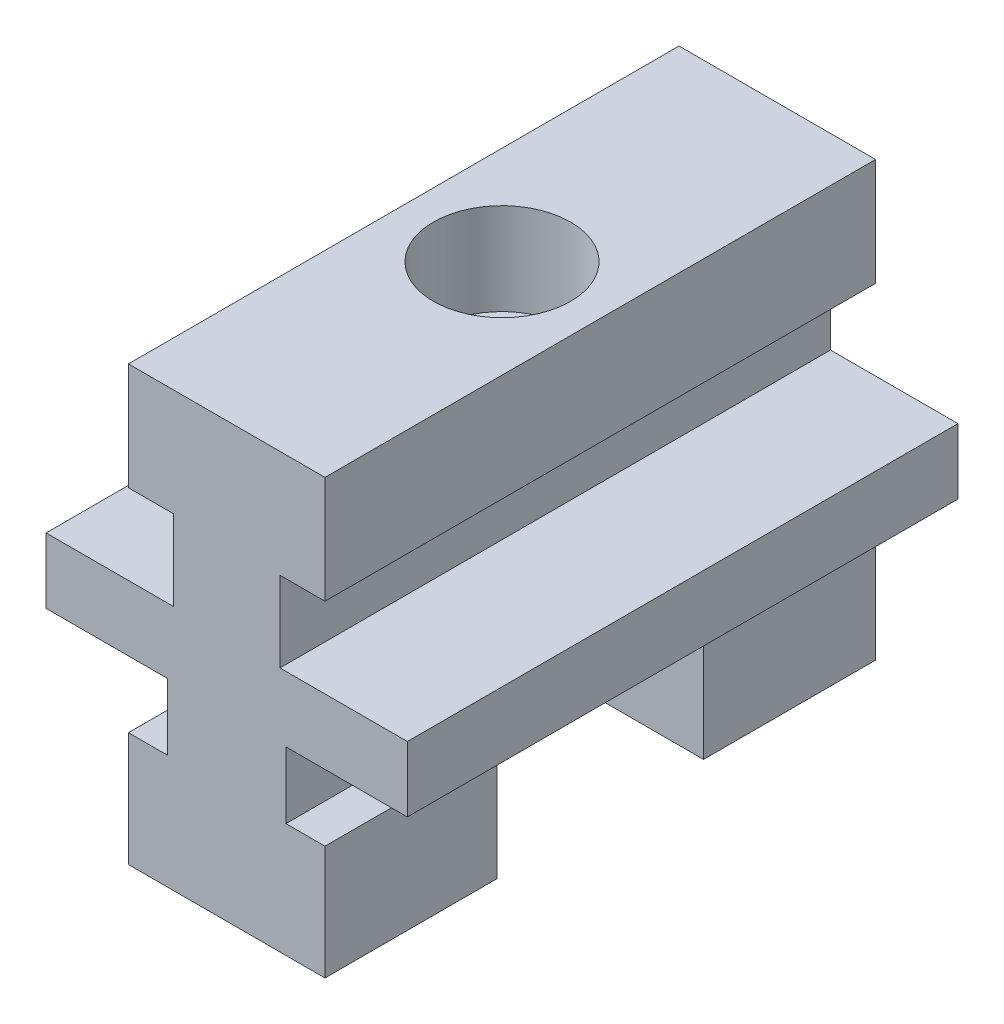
ISO-10303-21;
HEADER;
FILE_DESCRIPTION(('STEP AP214'),'2;1');
FILE_NAME('part.step','',(''),(''),'','','');
FILE_SCHEMA(('AUTOMOTIVE_DESIGN { 1 0 10303 214 1 1 1 1 }'));
ENDSEC;
DATA;
#1=APPLICATION_CONTEXT('core data for automotive mechanical design processes');
#2=APPLICATION_PROTOCOL_DEFINITION('international standard','automotive_design',2000,#1);
#3=PRODUCT_CONTEXT('',#1,'mechanical');
#4=PRODUCT('Part','Part','',(#3));
#5=PRODUCT_RELATED_PRODUCT_CATEGORY('part','',(#4));
#6=PRODUCT_DEFINITION_FORMATION('','',#4);
#7=PRODUCT_DEFINITION_CONTEXT('part definition',#1,'design');
#8=PRODUCT_DEFINITION('design','',#6,#7);
#9=PRODUCT_DEFINITION_SHAPE('','',#8);
#10=(LENGTH_UNIT() NAMED_UNIT(*) SI_UNIT(.MILLI.,.METRE.));
#11=(NAMED_UNIT(*) PLANE_ANGLE_UNIT() SI_UNIT($,.RADIAN.));
#12=(NAMED_UNIT(*) SI_UNIT($,.STERADIAN.) SOLID_ANGLE_UNIT());
#13=UNCERTAINTY_MEASURE_WITH_UNIT(LENGTH_MEASURE(1.E-05),#10,'distance_accuracy_value','');
#14=(GEOMETRIC_REPRESENTATION_CONTEXT(3) GLOBAL_UNCERTAINTY_ASSIGNED_CONTEXT((#13)) GLOBAL_UNIT_ASSIGNED_CONTEXT((#10,
#11,#12)) REPRESENTATION_CONTEXT('',''));
#15=CARTESIAN_POINT('',(0.,0.,0.));
#16=DIRECTION('',(0.,0.,1.));
#17=DIRECTION('',(1.,0.,0.));
#18=AXIS2_PLACEMENT_3D('',#15,#16,#17);
#19=CARTESIAN_POINT('',(6.79999999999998,-3.10199999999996,7.14375));
#20=DIRECTION('',(0.,0.,1.));
#21=DIRECTION('',(1.,0.,0.));
#22=AXIS2_PLACEMENT_3D('',#19,#20,#21);
#23=PLANE('',#22);
#24=DIRECTION('',(1.,0.,0.));
#25=VECTOR('',#24,1.);
#26=CARTESIAN_POINT('',(6.79999999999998,-3.10199999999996,7.14375));
#27=LINE('',#26,#25);
#28=CARTESIAN_POINT('',(-4.10000000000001,-3.10199999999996,7.14375));
#29=VERTEX_POINT('',#28);
#30=CARTESIAN_POINT('',(4.10000000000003,-3.10199999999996,7.14375));
#31=VERTEX_POINT('',#30);
#32=EDGE_CURVE('E239',#29,#31,#27,.T.);
#33=ORIENTED_EDGE('',*,*,#32,.T.);
#34=DIRECTION('',(0.,1.,0.));
#35=VECTOR('',#34,1.);
#36=CARTESIAN_POINT('',(4.10000000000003,-3.10199999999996,7.14375));
#37=LINE('',#36,#35);
#38=CARTESIAN_POINT('',(4.10000000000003,-4.59999999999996,7.14375));
#39=VERTEX_POINT('',#38);
#40=EDGE_CURVE('E245',#39,#31,#37,.T.);
#41=ORIENTED_EDGE('',*,*,#40,.F.);
#42=DIRECTION('',(1.,0.,0.));
#43=VECTOR('',#42,1.);
#44=CARTESIAN_POINT('',(4.10000000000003,-4.59999999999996,7.14375));
#45=LINE('',#44,#43);
#46=CARTESIAN_POINT('',(6.79999999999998,-4.59999999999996,7.14375));
#47=VERTEX_POINT('',#46);
#48=EDGE_CURVE('E349',#47,#39,#45,.F.);
#49=ORIENTED_EDGE('',*,*,#48,.F.);
#50=DIRECTION('',(0.,1.,0.));
#51=VECTOR('',#50,1.);
#52=CARTESIAN_POINT('',(6.79999999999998,-4.59999999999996,7.14375));
#53=LINE('',#52,#51);
#54=CARTESIAN_POINT('',(6.79999999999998,-12.5,7.14375));
#55=VERTEX_POINT('',#54);
#56=EDGE_CURVE('E355',#55,#47,#53,.T.);
#57=ORIENTED_EDGE('',*,*,#56,.F.);
#58=DIRECTION('',(1.,0.,0.));
#59=VECTOR('',#58,1.);
#60=CARTESIAN_POINT('',(6.79999999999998,-12.5,7.14375));
#61=LINE('',#60,#59);
#62=CARTESIAN_POINT('',(-6.80000000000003,-12.5,7.14375));
#63=VERTEX_POINT('',#62);
#64=EDGE_CURVE('E209',#63,#55,#61,.T.);
#65=ORIENTED_EDGE('',*,*,#64,.F.);
#66=DIRECTION('',(0.,1.,0.));
#67=VECTOR('',#66,1.);
#68=CARTESIAN_POINT('',(-6.80000000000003,-12.5,7.14375));
#69=LINE('',#68,#67);
#70=CARTESIAN_POINT('',(-6.80000000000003,-4.59999999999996,7.14375));
#71=VERTEX_POINT('',#70);
#72=EDGE_CURVE('E212',#71,#63,#69,.F.);
#73=ORIENTED_EDGE('',*,*,#72,.F.);
#74=DIRECTION('',(1.,0.,0.));
#75=VECTOR('',#74,1.);
#76=CARTESIAN_POINT('',(-6.80000000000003,-4.59999999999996,7.14375));
#77=LINE('',#76,#75);
#78=CARTESIAN_POINT('',(-4.10000000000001,-4.59999999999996,7.14375));
#79=VERTEX_POINT('',#78);
#80=EDGE_CURVE('E215',#79,#71,#77,.F.);
#81=ORIENTED_EDGE('',*,*,#80,.F.);
#82=DIRECTION('',(0.,1.,0.));
#83=VECTOR('',#82,1.);
#84=CARTESIAN_POINT('',(-4.10000000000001,-3.10199999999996,7.14375));
#85=LINE('',#84,#83);
#86=EDGE_CURVE('E243',#29,#79,#85,.F.);
#87=ORIENTED_EDGE('',*,*,#86,.F.);
#88=EDGE_LOOP('',(#33,#41,#49,#57,#65,#73,#81,#87));
#89=FACE_BOUND('',#88,.T.);
#90=ADVANCED_FACE('F15',(#89),#23,.F.);
#91=CARTESIAN_POINT('',(6.79999999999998,-12.5,-7.14375));
#92=DIRECTION('',(0.,0.,-1.));
#93=DIRECTION('',(-1.,0.,0.));
#94=AXIS2_PLACEMENT_3D('',#91,#92,#93);
#95=PLANE('',#94);
#96=DIRECTION('',(1.,0.,0.));
#97=VECTOR('',#96,1.);
#98=CARTESIAN_POINT('',(-6.80000000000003,-4.59999999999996,-7.14375));
#99=LINE('',#98,#97);
#100=CARTESIAN_POINT('',(-6.80000000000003,-4.59999999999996,-7.14375));
#101=VERTEX_POINT('',#100);
#102=CARTESIAN_POINT('',(-4.10000000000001,-4.59999999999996,-7.14375));
#103=VERTEX_POINT('',#102);
#104=EDGE_CURVE('E324',#101,#103,#99,.T.);
#105=ORIENTED_EDGE('',*,*,#104,.F.);
#106=DIRECTION('',(0.,1.,0.));
#107=VECTOR('',#106,1.);
#108=CARTESIAN_POINT('',(-6.80000000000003,-12.5,-7.14375));
#109=LINE('',#108,#107);
#110=CARTESIAN_POINT('',(-6.80000000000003,-12.5,-7.14375));
#111=VERTEX_POINT('',#110);
#112=EDGE_CURVE('E317',#111,#101,#109,.T.);
#113=ORIENTED_EDGE('',*,*,#112,.F.);
#114=DIRECTION('',(1.,0.,0.));
#115=VECTOR('',#114,1.);
#116=CARTESIAN_POINT('',(6.79999999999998,-12.5,-7.14375));
#117=LINE('',#116,#115);
#118=CARTESIAN_POINT('',(6.79999999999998,-12.5,-7.14375));
#119=VERTEX_POINT('',#118);
#120=EDGE_CURVE('E311',#119,#111,#117,.F.);
#121=ORIENTED_EDGE('',*,*,#120,.F.);
#122=DIRECTION('',(0.,1.,0.));
#123=VECTOR('',#122,1.);
#124=CARTESIAN_POINT('',(6.79999999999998,-4.59999999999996,-7.14375));
#125=LINE('',#124,#123);
#126=CARTESIAN_POINT('',(6.79999999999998,-4.59999999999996,-7.14375));
#127=VERTEX_POINT('',#126);
#128=EDGE_CURVE('E305',#127,#119,#125,.F.);
#129=ORIENTED_EDGE('',*,*,#128,.F.);
#130=DIRECTION('',(1.,0.,0.));
#131=VECTOR('',#130,1.);
#132=CARTESIAN_POINT('',(4.10000000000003,-4.59999999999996,-7.14375));
#133=LINE('',#132,#131);
#134=CARTESIAN_POINT('',(4.10000000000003,-4.59999999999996,-7.14375));
#135=VERTEX_POINT('',#134);
#136=EDGE_CURVE('E299',#135,#127,#133,.T.);
#137=ORIENTED_EDGE('',*,*,#136,.F.);
#138=DIRECTION('',(0.,1.,0.));
#139=VECTOR('',#138,1.);
#140=CARTESIAN_POINT('',(4.10000000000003,-12.5,-7.14375));
#141=LINE('',#140,#139);
#142=CARTESIAN_POINT('',(4.10000000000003,-3.10199999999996,-7.14375));
#143=VERTEX_POINT('',#142);
#144=EDGE_CURVE('E241',#143,#135,#141,.F.);
#145=ORIENTED_EDGE('',*,*,#144,.F.);
#146=DIRECTION('',(1.,0.,0.));
#147=VECTOR('',#146,1.);
#148=CARTESIAN_POINT('',(6.79999999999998,-3.10199999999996,-7.14375));
#149=LINE('',#148,#147);
#150=CARTESIAN_POINT('',(-4.10000000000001,-3.10199999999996,-7.14375));
#151=VERTEX_POINT('',#150);
#152=EDGE_CURVE('E237',#143,#151,#149,.F.);
#153=ORIENTED_EDGE('',*,*,#152,.T.);
#154=DIRECTION('',(0.,1.,0.));
#155=VECTOR('',#154,1.);
#156=CARTESIAN_POINT('',(-4.10000000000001,-4.59999999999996,-7.14375));
#157=LINE('',#156,#155);
#158=EDGE_CURVE('E330',#103,#151,#157,.T.);
#159=ORIENTED_EDGE('',*,*,#158,.F.);
#160=EDGE_LOOP('',(#105,#113,#121,#129,#137,#145,#153,#159));
#161=FACE_BOUND('',#160,.T.);
#162=ADVANCED_FACE('F567',(#161),#95,.F.);
#163=CARTESIAN_POINT('',(6.79999999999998,-3.10199999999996,-7.14375));
#164=DIRECTION('',(0.,1.,0.));
#165=DIRECTION('',(0.,0.,1.));
#166=AXIS2_PLACEMENT_3D('',#163,#164,#165);
#167=PLANE('',#166);
#168=CARTESIAN_POINT('',(0.,-3.10199999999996,0.));
#169=DIRECTION('',(0.,-1.,0.));
#170=DIRECTION('',(0.,0.,-1.));
#171=AXIS2_PLACEMENT_3D('',#168,#169,#170);
#172=CIRCLE('',#171,2.99999999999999);
#173=CARTESIAN_POINT('',(0.,-3.10199999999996,-3.));
#174=VERTEX_POINT('',#173);
#175=EDGE_CURVE('E19',#174,#174,#172,.F.);
#176=ORIENTED_EDGE('',*,*,#175,.T.);
#177=EDGE_LOOP('',(#176));
#178=FACE_BOUND('',#177,.T.);
#179=ORIENTED_EDGE('',*,*,#152,.F.);
#180=DIRECTION('',(0.,0.,-1.));
#181=VECTOR('',#180,1.);
#182=CARTESIAN_POINT('',(4.10000000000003,-3.10199999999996,0.));
#183=LINE('',#182,#181);
#184=EDGE_CURVE('E293',#31,#143,#183,.T.);
#185=ORIENTED_EDGE('',*,*,#184,.F.);
#186=ORIENTED_EDGE('',*,*,#32,.F.);
#187=DIRECTION('',(0.,0.,1.));
#188=VECTOR('',#187,1.);
#189=CARTESIAN_POINT('',(-4.10000000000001,-3.10199999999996,0.));
#190=LINE('',#189,#188);
#191=EDGE_CURVE('E327',#151,#29,#190,.T.);
#192=ORIENTED_EDGE('',*,*,#191,.F.);
#193=EDGE_LOOP('',(#179,#185,#186,#192));
#194=FACE_BOUND('',#193,.T.);
#195=ADVANCED_FACE('F413',(#178,#194),#167,.F.);
#196=CARTESIAN_POINT('',(0.,11.15,0.));
#197=DIRECTION('',(0.,-1.,0.));
#198=DIRECTION('',(0.,0.,-1.));
#199=AXIS2_PLACEMENT_3D('',#196,#197,#198);
#200=CYLINDRICAL_SURFACE('',#199,2.99999999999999);
#201=CARTESIAN_POINT('',(0.,11.15,0.));
#202=DIRECTION('',(0.,-1.,0.));
#203=DIRECTION('',(0.,0.,-1.));
#204=AXIS2_PLACEMENT_3D('',#201,#202,#203);
#205=CIRCLE('',#204,2.99999999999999);
#206=CARTESIAN_POINT('',(0.,11.15,-2.99999999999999));
#207=VERTEX_POINT('',#206);
#208=EDGE_CURVE('E251',#207,#207,#205,.F.);
#209=ORIENTED_EDGE('',*,*,#208,.T.);
#210=EDGE_LOOP('',(#209));
#211=FACE_BOUND('',#210,.T.);
#212=ORIENTED_EDGE('',*,*,#175,.F.);
#213=EDGE_LOOP('',(#212));
#214=FACE_BOUND('',#213,.T.);
#215=ADVANCED_FACE('F563',(#211,#214),#200,.F.);
#216=CARTESIAN_POINT('',(-6.80000000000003,-4.59999999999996,0.));
#217=DIRECTION('',(0.,1.,0.));
#218=DIRECTION('',(0.,0.,1.));
#219=AXIS2_PLACEMENT_3D('',#216,#217,#218);
#220=PLANE('',#219);
#221=DIRECTION('',(1.,0.,0.));
#222=VECTOR('',#221,1.);
#223=CARTESIAN_POINT('',(0.,-4.59999999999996,19.05));
#224=LINE('',#223,#222);
#225=CARTESIAN_POINT('',(-4.1,-4.59999999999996,19.05));
#226=VERTEX_POINT('',#225);
#227=CARTESIAN_POINT('',(-6.80000000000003,-4.59999999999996,19.05));
#228=VERTEX_POINT('',#227);
#229=EDGE_CURVE('E369',#226,#228,#224,.F.);
#230=ORIENTED_EDGE('',*,*,#229,.F.);
#231=DIRECTION('',(0.,0.,1.));
#232=VECTOR('',#231,1.);
#233=CARTESIAN_POINT('',(-4.10000000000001,-4.59999999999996,0.));
#234=LINE('',#233,#232);
#235=EDGE_CURVE('E226',#79,#226,#234,.T.);
#236=ORIENTED_EDGE('',*,*,#235,.F.);
#237=ORIENTED_EDGE('',*,*,#80,.T.);
#238=DIRECTION('',(0.,0.,1.));
#239=VECTOR('',#238,1.);
#240=CARTESIAN_POINT('',(-6.80000000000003,-4.59999999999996,0.));
#241=LINE('',#240,#239);
#242=EDGE_CURVE('E220',#228,#71,#241,.F.);
#243=ORIENTED_EDGE('',*,*,#242,.F.);
#244=EDGE_LOOP('',(#230,#236,#237,#243));
#245=FACE_BOUND('',#244,.T.);
#246=ADVANCED_FACE('F224',(#245),#220,.T.);
#247=CARTESIAN_POINT('',(-6.80000000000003,-12.5,0.));
#248=DIRECTION('',(-1.,0.,0.));
#249=DIRECTION('',(0.,0.,1.));
#250=AXIS2_PLACEMENT_3D('',#247,#248,#249);
#251=PLANE('',#250);
#252=DIRECTION('',(0.,1.,0.));
#253=VECTOR('',#252,1.);
#254=CARTESIAN_POINT('',(-6.80000000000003,2.50000000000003,19.05));
#255=LINE('',#254,#253);
#256=CARTESIAN_POINT('',(-6.80000000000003,-12.5,19.05));
#257=VERTEX_POINT('',#256);
#258=EDGE_CURVE('E230',#228,#257,#255,.F.);
#259=ORIENTED_EDGE('',*,*,#258,.F.);
#260=ORIENTED_EDGE('',*,*,#242,.T.);
#261=ORIENTED_EDGE('',*,*,#72,.T.);
#262=DIRECTION('',(0.,0.,-1.));
#263=VECTOR('',#262,1.);
#264=CARTESIAN_POINT('',(-6.80000000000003,-12.5,0.));
#265=LINE('',#264,#263);
#266=EDGE_CURVE('E233',#257,#63,#265,.T.);
#267=ORIENTED_EDGE('',*,*,#266,.F.);
#268=EDGE_LOOP('',(#259,#260,#261,#267));
#269=FACE_BOUND('',#268,.T.);
#270=ADVANCED_FACE('F228',(#269),#251,.T.);
#271=CARTESIAN_POINT('',(6.79999999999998,-12.5,0.));
#272=DIRECTION('',(0.,-1.,0.));
#273=DIRECTION('',(0.,0.,-1.));
#274=AXIS2_PLACEMENT_3D('',#271,#272,#273);
#275=PLANE('',#274);
#276=DIRECTION('',(1.,0.,0.));
#277=VECTOR('',#276,1.);
#278=CARTESIAN_POINT('',(0.,-12.5,19.05));
#279=LINE('',#278,#277);
#280=CARTESIAN_POINT('',(6.79999999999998,-12.5,19.05));
#281=VERTEX_POINT('',#280);
#282=EDGE_CURVE('E361',#257,#281,#279,.T.);
#283=ORIENTED_EDGE('',*,*,#282,.F.);
#284=ORIENTED_EDGE('',*,*,#266,.T.);
#285=ORIENTED_EDGE('',*,*,#64,.T.);
#286=DIRECTION('',(0.,0.,-1.));
#287=VECTOR('',#286,1.);
#288=CARTESIAN_POINT('',(6.79999999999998,-12.5,0.));
#289=LINE('',#288,#287);
#290=EDGE_CURVE('E352',#281,#55,#289,.T.);
#291=ORIENTED_EDGE('',*,*,#290,.F.);
#292=EDGE_LOOP('',(#283,#284,#285,#291));
#293=FACE_BOUND('',#292,.T.);
#294=ADVANCED_FACE('F359',(#293),#275,.T.);
#295=CARTESIAN_POINT('',(6.79999999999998,-4.59999999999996,0.));
#296=DIRECTION('',(1.,0.,0.));
#297=DIRECTION('',(0.,0.,-1.));
#298=AXIS2_PLACEMENT_3D('',#295,#296,#297);
#299=PLANE('',#298);
#300=DIRECTION('',(0.,1.,0.));
#301=VECTOR('',#300,1.);
#302=CARTESIAN_POINT('',(6.79999999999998,2.50000000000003,19.05));
#303=LINE('',#302,#301);
#304=CARTESIAN_POINT('',(6.79999999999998,-4.59999999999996,19.05));
#305=VERTEX_POINT('',#304);
#306=EDGE_CURVE('E365',#281,#305,#303,.T.);
#307=ORIENTED_EDGE('',*,*,#306,.F.);
#308=ORIENTED_EDGE('',*,*,#290,.T.);
#309=ORIENTED_EDGE('',*,*,#56,.T.);
#310=DIRECTION('',(0.,0.,1.));
#311=VECTOR('',#310,1.);
#312=CARTESIAN_POINT('',(6.79999999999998,-4.59999999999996,0.));
#313=LINE('',#312,#311);
#314=EDGE_CURVE('E346',#305,#47,#313,.F.);
#315=ORIENTED_EDGE('',*,*,#314,.F.);
#316=EDGE_LOOP('',(#307,#308,#309,#315));
#317=FACE_BOUND('',#316,.T.);
#318=ADVANCED_FACE('F424',(#317),#299,.T.);
#319=CARTESIAN_POINT('',(4.10000000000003,-4.59999999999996,0.));
#320=DIRECTION('',(0.,1.,0.));
#321=DIRECTION('',(0.,0.,1.));
#322=AXIS2_PLACEMENT_3D('',#319,#320,#321);
#323=PLANE('',#322);
#324=DIRECTION('',(1.,0.,0.));
#325=VECTOR('',#324,1.);
#326=CARTESIAN_POINT('',(0.,-4.59999999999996,19.05));
#327=LINE('',#326,#325);
#328=CARTESIAN_POINT('',(4.10000000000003,-4.59999999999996,19.05));
#329=VERTEX_POINT('',#328);
#330=EDGE_CURVE('E422',#305,#329,#327,.F.);
#331=ORIENTED_EDGE('',*,*,#330,.F.);
#332=ORIENTED_EDGE('',*,*,#314,.T.);
#333=ORIENTED_EDGE('',*,*,#48,.T.);
#334=DIRECTION('',(0.,0.,-1.));
#335=VECTOR('',#334,1.);
#336=CARTESIAN_POINT('',(4.10000000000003,-4.59999999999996,0.));
#337=LINE('',#336,#335);
#338=EDGE_CURVE('E287',#329,#39,#337,.T.);
#339=ORIENTED_EDGE('',*,*,#338,.F.);
#340=EDGE_LOOP('',(#331,#332,#333,#339));
#341=FACE_BOUND('',#340,.T.);
#342=ADVANCED_FACE('F420',(#341),#323,.T.);
#343=CARTESIAN_POINT('',(-3.68299999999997,4.52187500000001,19.05));
#344=DIRECTION('',(1.,0.,0.));
#345=DIRECTION('',(0.,0.,-1.));
#346=AXIS2_PLACEMENT_3D('',#343,#344,#345);
#347=PLANE('',#346);
#348=DIRECTION('',(0.,0.,-1.));
#349=VECTOR('',#348,1.);
#350=CARTESIAN_POINT('',(-3.68299999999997,4.52187500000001,19.05));
#351=LINE('',#350,#349);
#352=CARTESIAN_POINT('',(-3.68299999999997,4.52187500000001,-19.05));
#353=VERTEX_POINT('',#352);
#354=CARTESIAN_POINT('',(-3.68299999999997,4.52187500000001,19.05));
#355=VERTEX_POINT('',#354);
#356=EDGE_CURVE('E343',#353,#355,#351,.F.);
#357=ORIENTED_EDGE('',*,*,#356,.T.);
#358=DIRECTION('',(0.,1.,0.));
#359=VECTOR('',#358,1.);
#360=CARTESIAN_POINT('',(-3.68299999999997,2.50000000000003,19.05));
#361=LINE('',#360,#359);
#362=CARTESIAN_POINT('',(-3.68299999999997,10.078125,19.05));
#363=VERTEX_POINT('',#362);
#364=EDGE_CURVE('E261',#363,#355,#361,.F.);
#365=ORIENTED_EDGE('',*,*,#364,.F.);
#366=DIRECTION('',(0.,0.,1.));
#367=VECTOR('',#366,1.);
#368=CARTESIAN_POINT('',(-3.68299999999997,10.078125,19.05));
#369=LINE('',#368,#367);
#370=CARTESIAN_POINT('',(-3.68299999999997,10.078125,-19.05));
#371=VERTEX_POINT('',#370);
#372=EDGE_CURVE('E255',#363,#371,#369,.F.);
#373=ORIENTED_EDGE('',*,*,#372,.T.);
#374=DIRECTION('',(0.,1.,0.));
#375=VECTOR('',#374,1.);
#376=CARTESIAN_POINT('',(-3.68299999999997,2.50000000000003,-19.05));
#377=LINE('',#376,#375);
#378=EDGE_CURVE('E390',#371,#353,#377,.F.);
#379=ORIENTED_EDGE('',*,*,#378,.T.);
#380=EDGE_LOOP('',(#357,#365,#373,#379));
#381=FACE_BOUND('',#380,.T.);
#382=ADVANCED_FACE('F387',(#381),#347,.F.);
#383=CARTESIAN_POINT('',(-12.5,4.52187500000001,19.05));
#384=DIRECTION('',(0.,-1.,0.));
#385=DIRECTION('',(0.,0.,-1.));
#386=AXIS2_PLACEMENT_3D('',#383,#384,#385);
#387=PLANE('',#386);
#388=DIRECTION('',(0.,0.,1.));
#389=VECTOR('',#388,1.);
#390=CARTESIAN_POINT('',(-12.5,4.52187500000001,0.));
#391=LINE('',#390,#389);
#392=CARTESIAN_POINT('',(-12.5,4.52187500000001,19.05));
#393=VERTEX_POINT('',#392);
#394=CARTESIAN_POINT('',(-12.5,4.52187500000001,-19.05));
#395=VERTEX_POINT('',#394);
#396=EDGE_CURVE('E340',#393,#395,#391,.F.);
#397=ORIENTED_EDGE('',*,*,#396,.F.);
#398=DIRECTION('',(1.,0.,0.));
#399=VECTOR('',#398,1.);
#400=CARTESIAN_POINT('',(0.,4.52187500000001,19.05));
#401=LINE('',#400,#399);
#402=EDGE_CURVE('E382',#355,#393,#401,.F.);
#403=ORIENTED_EDGE('',*,*,#402,.F.);
#404=ORIENTED_EDGE('',*,*,#356,.F.);
#405=DIRECTION('',(1.,0.,0.));
#406=VECTOR('',#405,1.);
#407=CARTESIAN_POINT('',(0.,4.52187500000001,-19.05));
#408=LINE('',#407,#406);
#409=EDGE_CURVE('E395',#353,#395,#408,.F.);
#410=ORIENTED_EDGE('',*,*,#409,.T.);
#411=EDGE_LOOP('',(#397,#403,#404,#410));
#412=FACE_BOUND('',#411,.T.);
#413=ADVANCED_FACE('F393',(#412),#387,.F.);
#414=CARTESIAN_POINT('',(-12.5,0.,0.));
#415=DIRECTION('',(-1.,0.,0.));
#416=DIRECTION('',(0.,0.,1.));
#417=AXIS2_PLACEMENT_3D('',#414,#415,#416);
#418=PLANE('',#417);
#419=DIRECTION('',(0.,0.,-1.));
#420=VECTOR('',#419,1.);
#421=CARTESIAN_POINT('',(-12.5,0.,0.));
#422=LINE('',#421,#420);
#423=CARTESIAN_POINT('',(-12.5,0.,19.05));
#424=VERTEX_POINT('',#423);
#425=CARTESIAN_POINT('',(-12.5,0.,-19.05));
#426=VERTEX_POINT('',#425);
#427=EDGE_CURVE('E337',#424,#426,#422,.T.);
#428=ORIENTED_EDGE('',*,*,#427,.F.);
#429=DIRECTION('',(0.,1.,0.));
#430=VECTOR('',#429,1.);
#431=CARTESIAN_POINT('',(-12.5,2.50000000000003,19.05));
#432=LINE('',#431,#430);
#433=EDGE_CURVE('E379',#393,#424,#432,.F.);
#434=ORIENTED_EDGE('',*,*,#433,.F.);
#435=ORIENTED_EDGE('',*,*,#396,.T.);
#436=DIRECTION('',(0.,1.,0.));
#437=VECTOR('',#436,1.);
#438=CARTESIAN_POINT('',(-12.5,2.50000000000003,-19.05));
#439=LINE('',#438,#437);
#440=EDGE_CURVE('E456',#395,#426,#439,.F.);
#441=ORIENTED_EDGE('',*,*,#440,.T.);
#442=EDGE_LOOP('',(#428,#434,#435,#441));
#443=FACE_BOUND('',#442,.T.);
#444=ADVANCED_FACE('F398',(#443),#418,.T.);
#445=CARTESIAN_POINT('',(-4.09999999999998,0.,0.));
#446=DIRECTION('',(0.,-1.,0.));
#447=DIRECTION('',(0.,0.,-1.));
#448=AXIS2_PLACEMENT_3D('',#445,#446,#447);
#449=PLANE('',#448);
#450=DIRECTION('',(1.,0.,0.));
#451=VECTOR('',#450,1.);
#452=CARTESIAN_POINT('',(0.,0.,-19.05));
#453=LINE('',#452,#451);
#454=CARTESIAN_POINT('',(-4.09999999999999,0.,-19.05));
#455=VERTEX_POINT('',#454);
#456=EDGE_CURVE('E404',#426,#455,#453,.T.);
#457=ORIENTED_EDGE('',*,*,#456,.T.);
#458=DIRECTION('',(0.,0.,1.));
#459=VECTOR('',#458,1.);
#460=CARTESIAN_POINT('',(-4.10000000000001,0.,0.));
#461=LINE('',#460,#459);
#462=CARTESIAN_POINT('',(-4.09999999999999,0.,19.05));
#463=VERTEX_POINT('',#462);
#464=EDGE_CURVE('E333',#463,#455,#461,.F.);
#465=ORIENTED_EDGE('',*,*,#464,.F.);
#466=DIRECTION('',(1.,0.,0.));
#467=VECTOR('',#466,1.);
#468=CARTESIAN_POINT('',(0.,0.,19.05));
#469=LINE('',#468,#467);
#470=EDGE_CURVE('E376',#424,#463,#469,.T.);
#471=ORIENTED_EDGE('',*,*,#470,.F.);
#472=ORIENTED_EDGE('',*,*,#427,.T.);
#473=EDGE_LOOP('',(#457,#465,#471,#472));
#474=FACE_BOUND('',#473,.T.);
#475=ADVANCED_FACE('F402',(#474),#449,.T.);
#476=CARTESIAN_POINT('',(-4.10000000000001,-4.59999999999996,0.));
#477=DIRECTION('',(-1.,0.,0.));
#478=DIRECTION('',(0.,0.,1.));
#479=AXIS2_PLACEMENT_3D('',#476,#477,#478);
#480=PLANE('',#479);
#481=ORIENTED_EDGE('',*,*,#158,.T.);
#482=ORIENTED_EDGE('',*,*,#191,.T.);
#483=ORIENTED_EDGE('',*,*,#86,.T.);
#484=ORIENTED_EDGE('',*,*,#235,.T.);
#485=DIRECTION('',(0.,1.,0.));
#486=VECTOR('',#485,1.);
#487=CARTESIAN_POINT('',(-4.09999999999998,2.50000000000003,19.05));
#488=LINE('',#487,#486);
#489=EDGE_CURVE('E371',#463,#226,#488,.F.);
#490=ORIENTED_EDGE('',*,*,#489,.F.);
#491=ORIENTED_EDGE('',*,*,#464,.T.);
#492=DIRECTION('',(0.,1.,0.));
#493=VECTOR('',#492,1.);
#494=CARTESIAN_POINT('',(-4.09999999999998,2.50000000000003,-19.05));
#495=LINE('',#494,#493);
#496=CARTESIAN_POINT('',(-4.1,-4.59999999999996,-19.05));
#497=VERTEX_POINT('',#496);
#498=EDGE_CURVE('E461',#455,#497,#495,.F.);
#499=ORIENTED_EDGE('',*,*,#498,.T.);
#500=DIRECTION('',(0.,0.,1.));
#501=VECTOR('',#500,1.);
#502=CARTESIAN_POINT('',(-4.10000000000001,-4.59999999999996,0.));
#503=LINE('',#502,#501);
#504=EDGE_CURVE('E320',#103,#497,#503,.F.);
#505=ORIENTED_EDGE('',*,*,#504,.F.);
#506=EDGE_LOOP('',(#481,#482,#483,#484,#490,#491,#499,#505));
#507=FACE_BOUND('',#506,.T.);
#508=ADVANCED_FACE('F407',(#507),#480,.T.);
#509=CARTESIAN_POINT('',(-6.80000000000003,-4.59999999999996,0.));
#510=DIRECTION('',(0.,1.,0.));
#511=DIRECTION('',(0.,0.,1.));
#512=AXIS2_PLACEMENT_3D('',#509,#510,#511);
#513=PLANE('',#512);
#514=DIRECTION('',(1.,0.,0.));
#515=VECTOR('',#514,1.);
#516=CARTESIAN_POINT('',(0.,-4.59999999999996,-19.05));
#517=LINE('',#516,#515);
#518=CARTESIAN_POINT('',(-6.80000000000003,-4.59999999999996,-19.05));
#519=VERTEX_POINT('',#518);
#520=EDGE_CURVE('E464',#497,#519,#517,.F.);
#521=ORIENTED_EDGE('',*,*,#520,.T.);
#522=DIRECTION('',(0.,0.,1.));
#523=VECTOR('',#522,1.);
#524=CARTESIAN_POINT('',(-6.80000000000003,-4.59999999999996,0.));
#525=LINE('',#524,#523);
#526=EDGE_CURVE('E314',#101,#519,#525,.F.);
#527=ORIENTED_EDGE('',*,*,#526,.F.);
#528=ORIENTED_EDGE('',*,*,#104,.T.);
#529=ORIENTED_EDGE('',*,*,#504,.T.);
#530=EDGE_LOOP('',(#521,#527,#528,#529));
#531=FACE_BOUND('',#530,.T.);
#532=ADVANCED_FACE('F593',(#531),#513,.T.);
#533=CARTESIAN_POINT('',(-6.80000000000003,-12.5,0.));
#534=DIRECTION('',(-1.,0.,0.));
#535=DIRECTION('',(0.,0.,1.));
#536=AXIS2_PLACEMENT_3D('',#533,#534,#535);
#537=PLANE('',#536);
#538=DIRECTION('',(0.,1.,0.));
#539=VECTOR('',#538,1.);
#540=CARTESIAN_POINT('',(-6.80000000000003,2.50000000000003,-19.05));
#541=LINE('',#540,#539);
#542=CARTESIAN_POINT('',(-6.80000000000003,-12.5,-19.05));
#543=VERTEX_POINT('',#542);
#544=EDGE_CURVE('E467',#519,#543,#541,.F.);
#545=ORIENTED_EDGE('',*,*,#544,.T.);
#546=DIRECTION('',(0.,0.,-1.));
#547=VECTOR('',#546,1.);
#548=CARTESIAN_POINT('',(-6.80000000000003,-12.5,0.));
#549=LINE('',#548,#547);
#550=EDGE_CURVE('E308',#111,#543,#549,.T.);
#551=ORIENTED_EDGE('',*,*,#550,.F.);
#552=ORIENTED_EDGE('',*,*,#112,.T.);
#553=ORIENTED_EDGE('',*,*,#526,.T.);
#554=EDGE_LOOP('',(#545,#551,#552,#553));
#555=FACE_BOUND('',#554,.T.);
#556=ADVANCED_FACE('F596',(#555),#537,.T.);
#557=CARTESIAN_POINT('',(6.79999999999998,-12.5,0.));
#558=DIRECTION('',(0.,-1.,0.));
#559=DIRECTION('',(0.,0.,-1.));
#560=AXIS2_PLACEMENT_3D('',#557,#558,#559);
#561=PLANE('',#560);
#562=DIRECTION('',(1.,0.,0.));
#563=VECTOR('',#562,1.);
#564=CARTESIAN_POINT('',(0.,-12.5,-19.05));
#565=LINE('',#564,#563);
#566=CARTESIAN_POINT('',(6.79999999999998,-12.5,-19.05));
#567=VERTEX_POINT('',#566);
#568=EDGE_CURVE('E469',#543,#567,#565,.T.);
#569=ORIENTED_EDGE('',*,*,#568,.T.);
#570=DIRECTION('',(0.,0.,-1.));
#571=VECTOR('',#570,1.);
#572=CARTESIAN_POINT('',(6.79999999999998,-12.5,0.));
#573=LINE('',#572,#571);
#574=EDGE_CURVE('E302',#119,#567,#573,.T.);
#575=ORIENTED_EDGE('',*,*,#574,.F.);
#576=ORIENTED_EDGE('',*,*,#120,.T.);
#577=ORIENTED_EDGE('',*,*,#550,.T.);
#578=EDGE_LOOP('',(#569,#575,#576,#577));
#579=FACE_BOUND('',#578,.T.);
#580=ADVANCED_FACE('F600',(#579),#561,.T.);
#581=CARTESIAN_POINT('',(6.79999999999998,-4.59999999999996,0.));
#582=DIRECTION('',(1.,0.,0.));
#583=DIRECTION('',(0.,0.,-1.));
#584=AXIS2_PLACEMENT_3D('',#581,#582,#583);
#585=PLANE('',#584);
#586=DIRECTION('',(0.,1.,0.));
#587=VECTOR('',#586,1.);
#588=CARTESIAN_POINT('',(6.79999999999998,2.50000000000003,-19.05));
#589=LINE('',#588,#587);
#590=CARTESIAN_POINT('',(6.79999999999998,-4.59999999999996,-19.05));
#591=VERTEX_POINT('',#590);
#592=EDGE_CURVE('E471',#567,#591,#589,.T.);
#593=ORIENTED_EDGE('',*,*,#592,.T.);
#594=DIRECTION('',(0.,0.,1.));
#595=VECTOR('',#594,1.);
#596=CARTESIAN_POINT('',(6.79999999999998,-4.59999999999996,0.));
#597=LINE('',#596,#595);
#598=EDGE_CURVE('E296',#127,#591,#597,.F.);
#599=ORIENTED_EDGE('',*,*,#598,.F.);
#600=ORIENTED_EDGE('',*,*,#128,.T.);
#601=ORIENTED_EDGE('',*,*,#574,.T.);
#602=EDGE_LOOP('',(#593,#599,#600,#601));
#603=FACE_BOUND('',#602,.T.);
#604=ADVANCED_FACE('F604',(#603),#585,.T.);
#605=CARTESIAN_POINT('',(4.10000000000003,-4.59999999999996,0.));
#606=DIRECTION('',(0.,1.,0.));
#607=DIRECTION('',(0.,0.,1.));
#608=AXIS2_PLACEMENT_3D('',#605,#606,#607);
#609=PLANE('',#608);
#610=DIRECTION('',(1.,0.,0.));
#611=VECTOR('',#610,1.);
#612=CARTESIAN_POINT('',(0.,-4.59999999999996,-19.05));
#613=LINE('',#612,#611);
#614=CARTESIAN_POINT('',(4.10000000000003,-4.59999999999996,-19.05));
#615=VERTEX_POINT('',#614);
#616=EDGE_CURVE('E473',#591,#615,#613,.F.);
#617=ORIENTED_EDGE('',*,*,#616,.T.);
#618=DIRECTION('',(0.,0.,-1.));
#619=VECTOR('',#618,1.);
#620=CARTESIAN_POINT('',(4.10000000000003,-4.59999999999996,0.));
#621=LINE('',#620,#619);
#622=EDGE_CURVE('E290',#135,#615,#621,.T.);
#623=ORIENTED_EDGE('',*,*,#622,.F.);
#624=ORIENTED_EDGE('',*,*,#136,.T.);
#625=ORIENTED_EDGE('',*,*,#598,.T.);
#626=EDGE_LOOP('',(#617,#623,#624,#625));
#627=FACE_BOUND('',#626,.T.);
#628=ADVANCED_FACE('F608',(#627),#609,.T.);
#629=CARTESIAN_POINT('',(4.10000000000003,0.,0.));
#630=DIRECTION('',(1.,0.,0.));
#631=DIRECTION('',(0.,0.,-1.));
#632=AXIS2_PLACEMENT_3D('',#629,#630,#631);
#633=PLANE('',#632);
#634=DIRECTION('',(0.,1.,0.));
#635=VECTOR('',#634,1.);
#636=CARTESIAN_POINT('',(4.10000000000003,2.50000000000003,19.05));
#637=LINE('',#636,#635);
#638=CARTESIAN_POINT('',(4.10000000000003,0.,19.05));
#639=VERTEX_POINT('',#638);
#640=EDGE_CURVE('E425',#329,#639,#637,.T.);
#641=ORIENTED_EDGE('',*,*,#640,.F.);
#642=ORIENTED_EDGE('',*,*,#338,.T.);
#643=ORIENTED_EDGE('',*,*,#40,.T.);
#644=ORIENTED_EDGE('',*,*,#184,.T.);
#645=ORIENTED_EDGE('',*,*,#144,.T.);
#646=ORIENTED_EDGE('',*,*,#622,.T.);
#647=DIRECTION('',(0.,1.,0.));
#648=VECTOR('',#647,1.);
#649=CARTESIAN_POINT('',(4.10000000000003,2.50000000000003,-19.05));
#650=LINE('',#649,#648);
#651=CARTESIAN_POINT('',(4.10000000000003,0.,-19.05));
#652=VERTEX_POINT('',#651);
#653=EDGE_CURVE('E475',#615,#652,#650,.T.);
#654=ORIENTED_EDGE('',*,*,#653,.T.);
#655=DIRECTION('',(0.,0.,-1.));
#656=VECTOR('',#655,1.);
#657=CARTESIAN_POINT('',(4.10000000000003,0.,0.));
#658=LINE('',#657,#656);
#659=EDGE_CURVE('E283',#639,#652,#658,.T.);
#660=ORIENTED_EDGE('',*,*,#659,.F.);
#661=EDGE_LOOP('',(#641,#642,#643,#644,#645,#646,#654,#660));
#662=FACE_BOUND('',#661,.T.);
#663=ADVANCED_FACE('F416',(#662),#633,.T.);
#664=CARTESIAN_POINT('',(12.5,0.,0.));
#665=DIRECTION('',(0.,-1.,0.));
#666=DIRECTION('',(0.,0.,-1.));
#667=AXIS2_PLACEMENT_3D('',#664,#665,#666);
#668=PLANE('',#667);
#669=DIRECTION('',(1.,0.,0.));
#670=VECTOR('',#669,1.);
#671=CARTESIAN_POINT('',(0.,0.,-19.05));
#672=LINE('',#671,#670);
#673=CARTESIAN_POINT('',(12.5,0.,-19.05));
#674=VERTEX_POINT('',#673);
#675=EDGE_CURVE('E477',#652,#674,#672,.T.);
#676=ORIENTED_EDGE('',*,*,#675,.T.);
#677=DIRECTION('',(0.,0.,-1.));
#678=VECTOR('',#677,1.);
#679=CARTESIAN_POINT('',(12.5,0.,0.));
#680=LINE('',#679,#678);
#681=CARTESIAN_POINT('',(12.5,0.,19.05));
#682=VERTEX_POINT('',#681);
#683=EDGE_CURVE('E280',#682,#674,#680,.T.);
#684=ORIENTED_EDGE('',*,*,#683,.F.);
#685=DIRECTION('',(1.,0.,0.));
#686=VECTOR('',#685,1.);
#687=CARTESIAN_POINT('',(0.,0.,19.05));
#688=LINE('',#687,#686);
#689=EDGE_CURVE('E430',#639,#682,#688,.T.);
#690=ORIENTED_EDGE('',*,*,#689,.F.);
#691=ORIENTED_EDGE('',*,*,#659,.T.);
#692=EDGE_LOOP('',(#676,#684,#690,#691));
#693=FACE_BOUND('',#692,.T.);
#694=ADVANCED_FACE('F615',(#693),#668,.T.);
#695=CARTESIAN_POINT('',(12.5,5.00000000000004,0.));
#696=DIRECTION('',(1.,0.,0.));
#697=DIRECTION('',(0.,0.,-1.));
#698=AXIS2_PLACEMENT_3D('',#695,#696,#697);
#699=PLANE('',#698);
#700=ORIENTED_EDGE('',*,*,#683,.T.);
#701=DIRECTION('',(0.,1.,0.));
#702=VECTOR('',#701,1.);
#703=CARTESIAN_POINT('',(12.5,2.50000000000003,-19.05));
#704=LINE('',#703,#702);
#705=CARTESIAN_POINT('',(12.5,4.52187500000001,-19.05));
#706=VERTEX_POINT('',#705);
#707=EDGE_CURVE('E479',#674,#706,#704,.T.);
#708=ORIENTED_EDGE('',*,*,#707,.T.);
#709=DIRECTION('',(0.,0.,-1.));
#710=VECTOR('',#709,1.);
#711=CARTESIAN_POINT('',(12.5,4.52187500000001,19.05));
#712=LINE('',#711,#710);
#713=CARTESIAN_POINT('',(12.5,4.52187500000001,19.05));
#714=VERTEX_POINT('',#713);
#715=EDGE_CURVE('E277',#706,#714,#712,.F.);
#716=ORIENTED_EDGE('',*,*,#715,.T.);
#717=DIRECTION('',(0.,1.,0.));
#718=VECTOR('',#717,1.);
#719=CARTESIAN_POINT('',(12.5,2.50000000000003,19.05));
#720=LINE('',#719,#718);
#721=EDGE_CURVE('E433',#682,#714,#720,.T.);
#722=ORIENTED_EDGE('',*,*,#721,.F.);
#723=EDGE_LOOP('',(#700,#708,#716,#722));
#724=FACE_BOUND('',#723,.T.);
#725=ADVANCED_FACE('F618',(#724),#699,.T.);
#726=CARTESIAN_POINT('',(3.68300000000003,4.52187500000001,19.05));
#727=DIRECTION('',(0.,-1.,0.));
#728=DIRECTION('',(0.,0.,-1.));
#729=AXIS2_PLACEMENT_3D('',#726,#727,#728);
#730=PLANE('',#729);
#731=DIRECTION('',(0.,0.,1.));
#732=VECTOR('',#731,1.);
#733=CARTESIAN_POINT('',(3.68300000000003,4.52187500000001,19.05));
#734=LINE('',#733,#732);
#735=CARTESIAN_POINT('',(3.68300000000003,4.52187500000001,-19.05));
#736=VERTEX_POINT('',#735);
#737=CARTESIAN_POINT('',(3.68300000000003,4.52187500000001,19.05));
#738=VERTEX_POINT('',#737);
#739=EDGE_CURVE('E271',#736,#738,#734,.T.);
#740=ORIENTED_EDGE('',*,*,#739,.T.);
#741=DIRECTION('',(1.,0.,0.));
#742=VECTOR('',#741,1.);
#743=CARTESIAN_POINT('',(0.,4.52187500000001,19.05));
#744=LINE('',#743,#742);
#745=EDGE_CURVE('E436',#714,#738,#744,.F.);
#746=ORIENTED_EDGE('',*,*,#745,.F.);
#747=ORIENTED_EDGE('',*,*,#715,.F.);
#748=DIRECTION('',(1.,0.,0.));
#749=VECTOR('',#748,1.);
#750=CARTESIAN_POINT('',(0.,4.52187500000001,-19.05));
#751=LINE('',#750,#749);
#752=EDGE_CURVE('E481',#706,#736,#751,.F.);
#753=ORIENTED_EDGE('',*,*,#752,.T.);
#754=EDGE_LOOP('',(#740,#746,#747,#753));
#755=FACE_BOUND('',#754,.T.);
#756=ADVANCED_FACE('F622',(#755),#730,.F.);
#757=CARTESIAN_POINT('',(3.68300000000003,10.078125,19.05));
#758=DIRECTION('',(-1.,0.,0.));
#759=DIRECTION('',(0.,0.,1.));
#760=AXIS2_PLACEMENT_3D('',#757,#758,#759);
#761=PLANE('',#760);
#762=DIRECTION('',(0.,0.,1.));
#763=VECTOR('',#762,1.);
#764=CARTESIAN_POINT('',(3.68300000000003,10.078125,19.05));
#765=LINE('',#764,#763);
#766=CARTESIAN_POINT('',(3.68300000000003,10.078125,-19.05));
#767=VERTEX_POINT('',#766);
#768=CARTESIAN_POINT('',(3.68300000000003,10.078125,19.05));
#769=VERTEX_POINT('',#768);
#770=EDGE_CURVE('E264',#767,#769,#765,.T.);
#771=ORIENTED_EDGE('',*,*,#770,.T.);
#772=DIRECTION('',(0.,1.,0.));
#773=VECTOR('',#772,1.);
#774=CARTESIAN_POINT('',(3.68300000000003,2.50000000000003,19.05));
#775=LINE('',#774,#773);
#776=EDGE_CURVE('E439',#738,#769,#775,.T.);
#777=ORIENTED_EDGE('',*,*,#776,.F.);
#778=ORIENTED_EDGE('',*,*,#739,.F.);
#779=DIRECTION('',(0.,1.,0.));
#780=VECTOR('',#779,1.);
#781=CARTESIAN_POINT('',(3.68300000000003,2.50000000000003,-19.05));
#782=LINE('',#781,#780);
#783=EDGE_CURVE('E484',#736,#767,#782,.T.);
#784=ORIENTED_EDGE('',*,*,#783,.T.);
#785=EDGE_LOOP('',(#771,#777,#778,#784));
#786=FACE_BOUND('',#785,.T.);
#787=ADVANCED_FACE('F625',(#786),#761,.F.);
#788=CARTESIAN_POINT('',(6.79999999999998,10.078125,19.05));
#789=DIRECTION('',(0.,1.,0.));
#790=DIRECTION('',(0.,0.,1.));
#791=AXIS2_PLACEMENT_3D('',#788,#789,#790);
#792=PLANE('',#791);
#793=DIRECTION('',(0.,0.,-1.));
#794=VECTOR('',#793,1.);
#795=CARTESIAN_POINT('',(6.79999999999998,10.078125,0.));
#796=LINE('',#795,#794);
#797=CARTESIAN_POINT('',(6.79999999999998,10.078125,19.05));
#798=VERTEX_POINT('',#797);
#799=CARTESIAN_POINT('',(6.79999999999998,10.078125,-19.05));
#800=VERTEX_POINT('',#799);
#801=EDGE_CURVE('E445',#798,#800,#796,.T.);
#802=ORIENTED_EDGE('',*,*,#801,.F.);
#803=DIRECTION('',(1.,0.,0.));
#804=VECTOR('',#803,1.);
#805=CARTESIAN_POINT('',(0.,10.078125,19.05));
#806=LINE('',#805,#804);
#807=EDGE_CURVE('E442',#769,#798,#806,.T.);
#808=ORIENTED_EDGE('',*,*,#807,.F.);
#809=ORIENTED_EDGE('',*,*,#770,.F.);
#810=DIRECTION('',(1.,0.,0.));
#811=VECTOR('',#810,1.);
#812=CARTESIAN_POINT('',(0.,10.078125,-19.05));
#813=LINE('',#812,#811);
#814=EDGE_CURVE('E487',#767,#800,#813,.T.);
#815=ORIENTED_EDGE('',*,*,#814,.T.);
#816=EDGE_LOOP('',(#802,#808,#809,#815));
#817=FACE_BOUND('',#816,.T.);
#818=ADVANCED_FACE('F559',(#817),#792,.F.);
#819=CARTESIAN_POINT('',(-3.68299999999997,10.078125,19.05));
#820=DIRECTION('',(0.,1.,0.));
#821=DIRECTION('',(0.,0.,1.));
#822=AXIS2_PLACEMENT_3D('',#819,#820,#821);
#823=PLANE('',#822);
#824=ORIENTED_EDGE('',*,*,#372,.F.);
#825=DIRECTION('',(1.,0.,0.));
#826=VECTOR('',#825,1.);
#827=CARTESIAN_POINT('',(0.,10.078125,19.05));
#828=LINE('',#827,#826);
#829=CARTESIAN_POINT('',(-6.8,10.078125,19.05));
#830=VERTEX_POINT('',#829);
#831=EDGE_CURVE('E254',#830,#363,#828,.T.);
#832=ORIENTED_EDGE('',*,*,#831,.F.);
#833=DIRECTION('',(0.,0.,1.));
#834=VECTOR('',#833,1.);
#835=CARTESIAN_POINT('',(-6.8,10.078125,0.));
#836=LINE('',#835,#834);
#837=CARTESIAN_POINT('',(-6.8,10.078125,-19.05));
#838=VERTEX_POINT('',#837);
#839=EDGE_CURVE('E495',#838,#830,#836,.T.);
#840=ORIENTED_EDGE('',*,*,#839,.F.);
#841=DIRECTION('',(1.,0.,0.));
#842=VECTOR('',#841,1.);
#843=CARTESIAN_POINT('',(0.,10.078125,-19.05));
#844=LINE('',#843,#842);
#845=EDGE_CURVE('E493',#838,#371,#844,.T.);
#846=ORIENTED_EDGE('',*,*,#845,.T.);
#847=EDGE_LOOP('',(#824,#832,#840,#846));
#848=FACE_BOUND('',#847,.T.);
#849=ADVANCED_FACE('F552',(#848),#823,.F.);
#850=CARTESIAN_POINT('',(-4.845,11.15,-4.845));
#851=DIRECTION('',(0.,-1.,0.));
#852=DIRECTION('',(1.,0.,0.));
#853=AXIS2_PLACEMENT_3D('',#850,#851,#852);
#854=PLANE('',#853);
#855=ORIENTED_EDGE('',*,*,#208,.F.);
#856=EDGE_LOOP('',(#855));
#857=FACE_BOUND('',#856,.T.);
#858=CARTESIAN_POINT('',(0.,11.15,0.));
#859=DIRECTION('',(0.,-1.,0.));
#860=DIRECTION('',(0.,0.,-1.));
#861=AXIS2_PLACEMENT_3D('',#858,#859,#860);
#862=CIRCLE('',#861,4.75);
#863=CARTESIAN_POINT('',(0.,11.15,-4.75));
#864=VERTEX_POINT('',#863);
#865=EDGE_CURVE('E247',#864,#864,#862,.F.);
#866=ORIENTED_EDGE('',*,*,#865,.T.);
#867=EDGE_LOOP('',(#866));
#868=FACE_BOUND('',#867,.T.);
#869=ADVANCED_FACE('F550',(#857,#868),#854,.F.);
#870=CARTESIAN_POINT('',(0.,2.50000000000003,19.05));
#871=DIRECTION('',(0.,0.,1.));
#872=DIRECTION('',(1.,0.,0.));
#873=AXIS2_PLACEMENT_3D('',#870,#871,#872);
#874=PLANE('',#873);
#875=DIRECTION('',(1.,0.,0.));
#876=VECTOR('',#875,1.);
#877=CARTESIAN_POINT('',(-6.8,17.5,19.05));
#878=LINE('',#877,#876);
#879=CARTESIAN_POINT('',(-6.8,17.5,19.05));
#880=VERTEX_POINT('',#879);
#881=CARTESIAN_POINT('',(6.79999999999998,17.5,19.05));
#882=VERTEX_POINT('',#881);
#883=EDGE_CURVE('E250',#880,#882,#878,.T.);
#884=ORIENTED_EDGE('',*,*,#883,.F.);
#885=DIRECTION('',(0.,1.,0.));
#886=VECTOR('',#885,1.);
#887=CARTESIAN_POINT('',(-6.8,9.6,19.05));
#888=LINE('',#887,#886);
#889=EDGE_CURVE('E498',#830,#880,#888,.T.);
#890=ORIENTED_EDGE('',*,*,#889,.F.);
#891=ORIENTED_EDGE('',*,*,#831,.T.);
#892=ORIENTED_EDGE('',*,*,#364,.T.);
#893=ORIENTED_EDGE('',*,*,#402,.T.);
#894=ORIENTED_EDGE('',*,*,#433,.T.);
#895=ORIENTED_EDGE('',*,*,#470,.T.);
#896=ORIENTED_EDGE('',*,*,#489,.T.);
#897=ORIENTED_EDGE('',*,*,#229,.T.);
#898=ORIENTED_EDGE('',*,*,#258,.T.);
#899=ORIENTED_EDGE('',*,*,#282,.T.);
#900=ORIENTED_EDGE('',*,*,#306,.T.);
#901=ORIENTED_EDGE('',*,*,#330,.T.);
#902=ORIENTED_EDGE('',*,*,#640,.T.);
#903=ORIENTED_EDGE('',*,*,#689,.T.);
#904=ORIENTED_EDGE('',*,*,#721,.T.);
#905=ORIENTED_EDGE('',*,*,#745,.T.);
#906=ORIENTED_EDGE('',*,*,#776,.T.);
#907=ORIENTED_EDGE('',*,*,#807,.T.);
#908=DIRECTION('',(0.,1.,0.));
#909=VECTOR('',#908,1.);
#910=CARTESIAN_POINT('',(6.79999999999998,17.5,19.05));
#911=LINE('',#910,#909);
#912=EDGE_CURVE('E449',#882,#798,#911,.F.);
#913=ORIENTED_EDGE('',*,*,#912,.F.);
#914=EDGE_LOOP('',(#884,#890,#891,#892,#893,#894,#895,#896,#897,#898,#899,#900,#901,#902,#903,
#904,#905,#906,#907,#913));
#915=FACE_BOUND('',#914,.T.);
#916=ADVANCED_FACE('F367',(#915),#874,.T.);
#917=CARTESIAN_POINT('',(6.79999999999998,17.5,0.));
#918=DIRECTION('',(1.,0.,0.));
#919=DIRECTION('',(0.,0.,-1.));
#920=AXIS2_PLACEMENT_3D('',#917,#918,#919);
#921=PLANE('',#920);
#922=DIRECTION('',(0.,0.,1.));
#923=VECTOR('',#922,1.);
#924=CARTESIAN_POINT('',(6.79999999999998,17.5,0.));
#925=LINE('',#924,#923);
#926=CARTESIAN_POINT('',(6.79999999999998,17.5,-19.05));
#927=VERTEX_POINT('',#926);
#928=EDGE_CURVE('E505',#882,#927,#925,.F.);
#929=ORIENTED_EDGE('',*,*,#928,.F.);
#930=ORIENTED_EDGE('',*,*,#912,.T.);
#931=ORIENTED_EDGE('',*,*,#801,.T.);
#932=DIRECTION('',(0.,1.,0.));
#933=VECTOR('',#932,1.);
#934=CARTESIAN_POINT('',(6.79999999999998,2.50000000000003,-19.05));
#935=LINE('',#934,#933);
#936=EDGE_CURVE('E490',#800,#927,#935,.T.);
#937=ORIENTED_EDGE('',*,*,#936,.T.);
#938=EDGE_LOOP('',(#929,#930,#931,#937));
#939=FACE_BOUND('',#938,.T.);
#940=ADVANCED_FACE('F522',(#939),#921,.T.);
#941=CARTESIAN_POINT('',(0.,2.50000000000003,-19.05));
#942=DIRECTION('',(0.,0.,1.));
#943=DIRECTION('',(1.,0.,0.));
#944=AXIS2_PLACEMENT_3D('',#941,#942,#943);
#945=PLANE('',#944);
#946=DIRECTION('',(0.,1.,0.));
#947=VECTOR('',#946,1.);
#948=CARTESIAN_POINT('',(-6.8,9.6,-19.05));
#949=LINE('',#948,#947);
#950=CARTESIAN_POINT('',(-6.8,17.5,-19.05));
#951=VERTEX_POINT('',#950);
#952=EDGE_CURVE('E39',#951,#838,#949,.F.);
#953=ORIENTED_EDGE('',*,*,#952,.F.);
#954=DIRECTION('',(1.,0.,0.));
#955=VECTOR('',#954,1.);
#956=CARTESIAN_POINT('',(-6.8,17.5,-19.05));
#957=LINE('',#956,#955);
#958=EDGE_CURVE('E509',#927,#951,#957,.F.);
#959=ORIENTED_EDGE('',*,*,#958,.F.);
#960=ORIENTED_EDGE('',*,*,#936,.F.);
#961=ORIENTED_EDGE('',*,*,#814,.F.);
#962=ORIENTED_EDGE('',*,*,#783,.F.);
#963=ORIENTED_EDGE('',*,*,#752,.F.);
#964=ORIENTED_EDGE('',*,*,#707,.F.);
#965=ORIENTED_EDGE('',*,*,#675,.F.);
#966=ORIENTED_EDGE('',*,*,#653,.F.);
#967=ORIENTED_EDGE('',*,*,#616,.F.);
#968=ORIENTED_EDGE('',*,*,#592,.F.);
#969=ORIENTED_EDGE('',*,*,#568,.F.);
#970=ORIENTED_EDGE('',*,*,#544,.F.);
#971=ORIENTED_EDGE('',*,*,#520,.F.);
#972=ORIENTED_EDGE('',*,*,#498,.F.);
#973=ORIENTED_EDGE('',*,*,#456,.F.);
#974=ORIENTED_EDGE('',*,*,#440,.F.);
#975=ORIENTED_EDGE('',*,*,#409,.F.);
#976=ORIENTED_EDGE('',*,*,#378,.F.);
#977=ORIENTED_EDGE('',*,*,#845,.F.);
#978=EDGE_LOOP('',(#953,#959,#960,#961,#962,#963,#964,#965,#966,#967,#968,#969,#970,#971,#972,
#973,#974,#975,#976,#977));
#979=FACE_BOUND('',#978,.T.);
#980=ADVANCED_FACE('F525',(#979),#945,.F.);
#981=CARTESIAN_POINT('',(-6.8,9.6,0.));
#982=DIRECTION('',(-1.,0.,0.));
#983=DIRECTION('',(0.,0.,1.));
#984=AXIS2_PLACEMENT_3D('',#981,#982,#983);
#985=PLANE('',#984);
#986=DIRECTION('',(0.,0.,1.));
#987=VECTOR('',#986,1.);
#988=CARTESIAN_POINT('',(-6.8,17.5,0.));
#989=LINE('',#988,#987);
#990=EDGE_CURVE('E26',#951,#880,#989,.T.);
#991=ORIENTED_EDGE('',*,*,#990,.F.);
#992=ORIENTED_EDGE('',*,*,#952,.T.);
#993=ORIENTED_EDGE('',*,*,#839,.T.);
#994=ORIENTED_EDGE('',*,*,#889,.T.);
#995=EDGE_LOOP('',(#991,#992,#993,#994));
#996=FACE_BOUND('',#995,.T.);
#997=ADVANCED_FACE('F518',(#996),#985,.T.);
#998=CARTESIAN_POINT('',(0.,17.5,0.));
#999=DIRECTION('',(0.,-1.,0.));
#1000=DIRECTION('',(0.,0.,-1.));
#1001=AXIS2_PLACEMENT_3D('',#998,#999,#1000);
#1002=CYLINDRICAL_SURFACE('',#1001,4.75);
#1003=ORIENTED_EDGE('',*,*,#865,.F.);
#1004=EDGE_LOOP('',(#1003));
#1005=FACE_BOUND('',#1004,.T.);
#1006=CARTESIAN_POINT('',(0.,17.5,0.));
#1007=DIRECTION('',(0.,-1.,0.));
#1008=DIRECTION('',(0.,0.,-1.));
#1009=AXIS2_PLACEMENT_3D('',#1006,#1007,#1008);
#1010=CIRCLE('',#1009,4.75);
#1011=CARTESIAN_POINT('',(0.,17.5,-4.75));
#1012=VERTEX_POINT('',#1011);
#1013=EDGE_CURVE('E10',#1012,#1012,#1010,.T.);
#1014=ORIENTED_EDGE('',*,*,#1013,.F.);
#1015=EDGE_LOOP('',(#1014));
#1016=FACE_BOUND('',#1015,.T.);
#1017=ADVANCED_FACE('F17',(#1005,#1016),#1002,.F.);
#1018=CARTESIAN_POINT('',(-6.8,17.5,0.));
#1019=DIRECTION('',(0.,1.,0.));
#1020=DIRECTION('',(0.,0.,1.));
#1021=AXIS2_PLACEMENT_3D('',#1018,#1019,#1020);
#1022=PLANE('',#1021);
#1023=ORIENTED_EDGE('',*,*,#1013,.T.);
#1024=EDGE_LOOP('',(#1023));
#1025=FACE_BOUND('',#1024,.T.);
#1026=ORIENTED_EDGE('',*,*,#958,.T.);
#1027=ORIENTED_EDGE('',*,*,#990,.T.);
#1028=ORIENTED_EDGE('',*,*,#883,.T.);
#1029=ORIENTED_EDGE('',*,*,#928,.T.);
#1030=EDGE_LOOP('',(#1026,#1027,#1028,#1029));
#1031=FACE_BOUND('',#1030,.T.);
#1032=ADVANCED_FACE('F516',(#1025,#1031),#1022,.T.);
#1033=CLOSED_SHELL('',(#90,#162,#195,#215,#246,#270,#294,#318,#342,#382,#413,#444,#475,#508,
#532,#556,#580,#604,#628,#663,#694,#725,#756,#787,#818,#849,#869,#916,#940,#980,#997,#1017,#1032));
#1034=MANIFOLD_SOLID_BREP('B1',#1033);
#1035=ADVANCED_BREP_SHAPE_REPRESENTATION('',(#18,#1034),#14);
#1036=SHAPE_DEFINITION_REPRESENTATION(#9,#1035);
ENDSEC;
END-ISO-10303-21;
